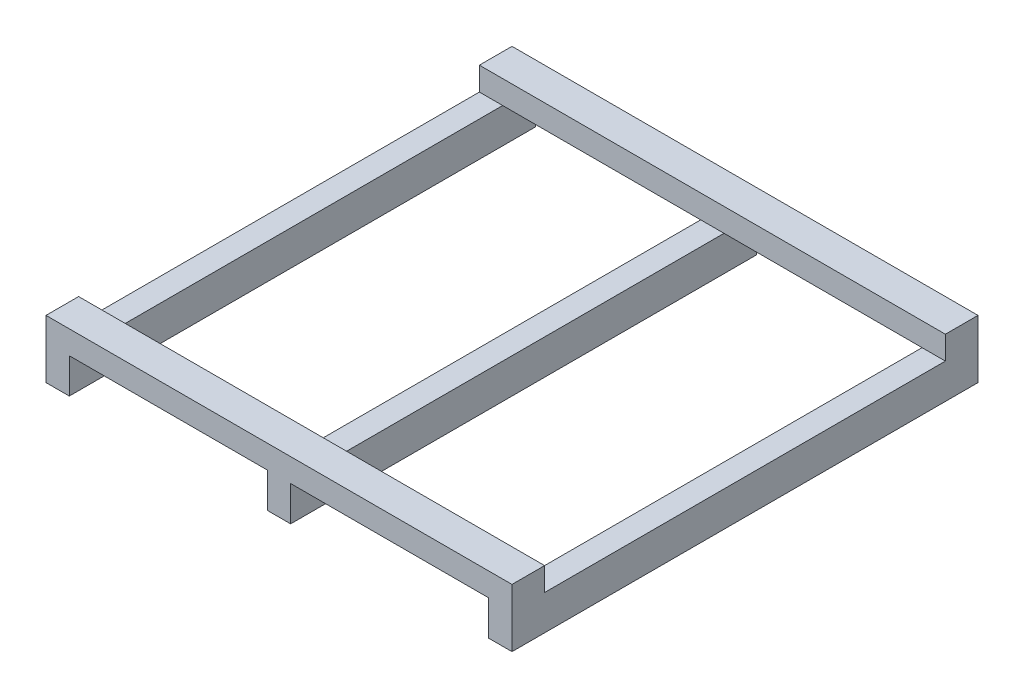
from build123d import *

# Parameters (mm, degrees)
BOSS_EXTRU_1_DEPTH        = 500
BOSS_EXTRU_1_DEPTH_BACK   = 500
ESQUISSE1_W               = 50
ESQUISSE1_H               = 75
BOSS_EXTRU_1_2_DEPTH      = 500
BOSS_EXTRU_1_2_DEPTH_BACK = 500
BOSS_EXTRU_1_3_DEPTH      = 500
BOSS_EXTRU_1_3_DEPTH_BACK = 500
BOSS_EXTRU_2_REACH        = 1122.547
ESQUISSE2_W               = 70
ESQUISSE2_H               = 50


with BuildPart() as part:
    # Esquisse1 → Boss.-Extru.1 (new, two sides: drawn at the far end of the back side and taken through both)
    with BuildSketch(Plane.XY.offset(-BOSS_EXTRU_1_DEPTH_BACK)):
        with Locations((-475, 37.5)):
            Rectangle(ESQUISSE1_W, ESQUISSE1_H)
    extrude(amount=BOSS_EXTRU_1_DEPTH + BOSS_EXTRU_1_DEPTH_BACK)


with BuildPart() as body_2:
    # Esquisse1 → Boss.-Extru.1 2 (new, two sides: drawn at the far end of the back side and taken through both)
    with BuildSketch(Plane.XY.offset(-BOSS_EXTRU_1_2_DEPTH_BACK)):
        with Locations((0, 37.5)):
            Rectangle(ESQUISSE1_W, ESQUISSE1_H)
    extrude(amount=BOSS_EXTRU_1_2_DEPTH + BOSS_EXTRU_1_2_DEPTH_BACK)


with BuildPart() as body_3:
    # Esquisse1 → Boss.-Extru.1 3 (new, two sides: drawn at the far end of the back side and taken through both)
    with BuildSketch(Plane.XY.offset(-BOSS_EXTRU_1_3_DEPTH_BACK)):
        with Locations((475, 37.5)):
            Rectangle(ESQUISSE1_W, ESQUISSE1_H)
    extrude(amount=BOSS_EXTRU_1_3_DEPTH + BOSS_EXTRU_1_3_DEPTH_BACK)

    # Boss.-Extru.2: up to this face of the body (flat: up to its plane)
    boss_extru_2_end = Plane(body_3.part.faces().sort_by_distance((500, 37.5, 0))[0])
    # Esquisse2 → Boss.-Extru.2 (add, up to the picked face)
    with BuildSketch(Plane.ZY.offset(500), mode=Mode.PRIVATE) as boss_extru_2_sk1:
        with Locations((-465, 100)):
            Rectangle(ESQUISSE2_W, ESQUISSE2_H)
    boss_extru_2_tool1 = split(extrude(boss_extru_2_sk1.sketch, amount=-BOSS_EXTRU_2_REACH, mode=Mode.PRIVATE), bisect_by=boss_extru_2_end, keep=Keep.BOTH, mode=Mode.PRIVATE)
    # Esquisse2 → Boss.-Extru.2 (add, up to the picked face)
    with BuildSketch(Plane.ZY.offset(500), mode=Mode.PRIVATE) as boss_extru_2_sk2:
        with Locations((465, 100)):
            Rectangle(ESQUISSE2_W, ESQUISSE2_H)
    boss_extru_2_tool2 = split(extrude(boss_extru_2_sk2.sketch, amount=-BOSS_EXTRU_2_REACH, mode=Mode.PRIVATE), bisect_by=boss_extru_2_end, keep=Keep.BOTH, mode=Mode.PRIVATE)

    add(part.part)  # Boss.-Extru.2 merges part

    add(body_2.part)  # Boss.-Extru.2 merges body 2
    add(boss_extru_2_tool1.solids().sort_by(Axis((-500, 100, -465), (1, 0, 0)))[0])
    add(boss_extru_2_tool2.solids().sort_by(Axis((-500, 100, 465), (1, 0, 0)))[0])


solid = body_3.part
